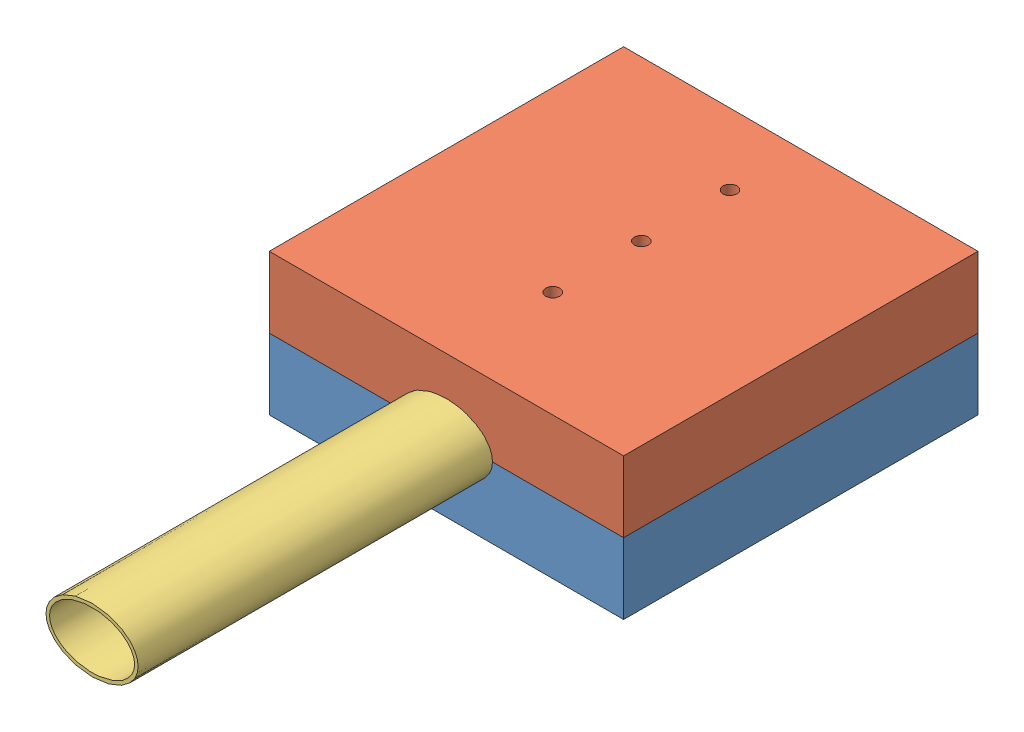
SolidWorks assembly 模具.SLDASM, configuration Default (file format 11000). Lengths in mm.
Overall size (100 40 200).
3 component instances, 3 part files, 0 mates.
Components (placement in the parent):
- down-1: down.SLDPRT [Default] at origin size (100 20 100)
- top-1: top.SLDPRT [Default] at origin size (100 20 100)
- 管件-1: 管件.SLDPRT [Default] at origin size (26 18.23 200)
